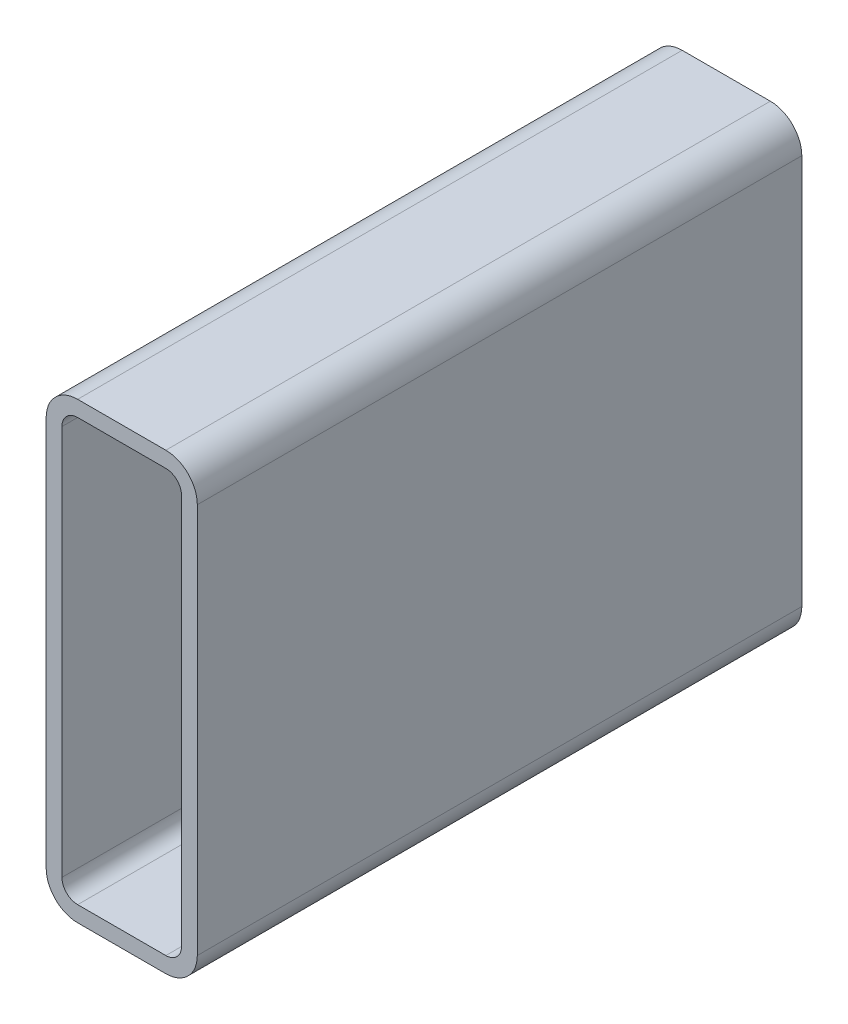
ISO-10303-21;
HEADER;
FILE_DESCRIPTION(('STEP AP214'),'2;1');
FILE_NAME('part.step','',(''),(''),'','','');
FILE_SCHEMA(('AUTOMOTIVE_DESIGN { 1 0 10303 214 1 1 1 1 }'));
ENDSEC;
DATA;
#1=APPLICATION_CONTEXT('core data for automotive mechanical design processes');
#2=APPLICATION_PROTOCOL_DEFINITION('international standard','automotive_design',2000,#1);
#3=PRODUCT_CONTEXT('',#1,'mechanical');
#4=PRODUCT('Part','Part','',(#3));
#5=PRODUCT_RELATED_PRODUCT_CATEGORY('part','',(#4));
#6=PRODUCT_DEFINITION_FORMATION('','',#4);
#7=PRODUCT_DEFINITION_CONTEXT('part definition',#1,'design');
#8=PRODUCT_DEFINITION('design','',#6,#7);
#9=PRODUCT_DEFINITION_SHAPE('','',#8);
#10=(LENGTH_UNIT() NAMED_UNIT(*) SI_UNIT(.MILLI.,.METRE.));
#11=(NAMED_UNIT(*) PLANE_ANGLE_UNIT() SI_UNIT($,.RADIAN.));
#12=(NAMED_UNIT(*) SI_UNIT($,.STERADIAN.) SOLID_ANGLE_UNIT());
#13=UNCERTAINTY_MEASURE_WITH_UNIT(LENGTH_MEASURE(1.E-05),#10,'distance_accuracy_value','');
#14=(GEOMETRIC_REPRESENTATION_CONTEXT(3) GLOBAL_UNCERTAINTY_ASSIGNED_CONTEXT((#13)) GLOBAL_UNIT_ASSIGNED_CONTEXT((#10,
#11,#12)) REPRESENTATION_CONTEXT('',''));
#15=CARTESIAN_POINT('',(0.,0.,0.));
#16=DIRECTION('',(0.,0.,1.));
#17=DIRECTION('',(1.,0.,0.));
#18=AXIS2_PLACEMENT_3D('',#15,#16,#17);
#19=CARTESIAN_POINT('',(18.3641160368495,214.668222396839,304.8));
#20=DIRECTION('',(0.,0.,1.));
#21=DIRECTION('',(1.,0.,0.));
#22=AXIS2_PLACEMENT_3D('',#19,#20,#21);
#23=PLANE('',#22);
#24=CARTESIAN_POINT('',(18.3641160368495,214.668222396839,304.8));
#25=DIRECTION('',(0.,0.,1.));
#26=DIRECTION('',(1.,0.,0.));
#27=AXIS2_PLACEMENT_3D('',#24,#25,#26);
#28=CIRCLE('',#27,15.875);
#29=CARTESIAN_POINT('',(18.3641160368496,230.543222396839,304.8));
#30=VERTEX_POINT('',#29);
#31=CARTESIAN_POINT('',(2.48911603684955,214.668222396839,304.8));
#32=VERTEX_POINT('',#31);
#33=EDGE_CURVE('E211',#30,#32,#28,.T.);
#34=ORIENTED_EDGE('',*,*,#33,.T.);
#35=DIRECTION('',(0.,-1.,0.));
#36=VECTOR('',#35,1.);
#37=CARTESIAN_POINT('',(2.48911603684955,17.8182223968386,304.8));
#38=LINE('',#37,#36);
#39=CARTESIAN_POINT('',(2.48911603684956,17.8182223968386,304.8));
#40=VERTEX_POINT('',#39);
#41=EDGE_CURVE('E214',#32,#40,#38,.T.);
#42=ORIENTED_EDGE('',*,*,#41,.T.);
#43=CARTESIAN_POINT('',(18.3641160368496,17.8182223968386,304.8));
#44=DIRECTION('',(0.,0.,1.));
#45=DIRECTION('',(1.,0.,0.));
#46=AXIS2_PLACEMENT_3D('',#43,#44,#45);
#47=CIRCLE('',#46,15.875);
#48=CARTESIAN_POINT('',(18.3641160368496,1.94322239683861,304.8));
#49=VERTEX_POINT('',#48);
#50=EDGE_CURVE('E217',#40,#49,#47,.T.);
#51=ORIENTED_EDGE('',*,*,#50,.T.);
#52=DIRECTION('',(1.,0.,0.));
#53=VECTOR('',#52,1.);
#54=CARTESIAN_POINT('',(62.8141160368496,1.94322239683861,304.8));
#55=LINE('',#54,#53);
#56=CARTESIAN_POINT('',(62.8141160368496,1.94322239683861,304.8));
#57=VERTEX_POINT('',#56);
#58=EDGE_CURVE('E219',#49,#57,#55,.T.);
#59=ORIENTED_EDGE('',*,*,#58,.T.);
#60=CARTESIAN_POINT('',(62.8141160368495,17.8182223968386,304.8));
#61=DIRECTION('',(0.,0.,1.));
#62=DIRECTION('',(1.,0.,0.));
#63=AXIS2_PLACEMENT_3D('',#60,#61,#62);
#64=CIRCLE('',#63,15.875);
#65=CARTESIAN_POINT('',(78.6891160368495,17.8182223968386,304.8));
#66=VERTEX_POINT('',#65);
#67=EDGE_CURVE('E221',#57,#66,#64,.T.);
#68=ORIENTED_EDGE('',*,*,#67,.T.);
#69=DIRECTION('',(0.,1.,0.));
#70=VECTOR('',#69,1.);
#71=CARTESIAN_POINT('',(78.6891160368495,214.668222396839,304.8));
#72=LINE('',#71,#70);
#73=CARTESIAN_POINT('',(78.6891160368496,214.668222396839,304.8));
#74=VERTEX_POINT('',#73);
#75=EDGE_CURVE('E223',#66,#74,#72,.T.);
#76=ORIENTED_EDGE('',*,*,#75,.T.);
#77=CARTESIAN_POINT('',(62.8141160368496,214.668222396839,304.8));
#78=DIRECTION('',(0.,0.,1.));
#79=DIRECTION('',(1.,0.,0.));
#80=AXIS2_PLACEMENT_3D('',#77,#78,#79);
#81=CIRCLE('',#80,15.875);
#82=CARTESIAN_POINT('',(62.8141160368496,230.543222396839,304.8));
#83=VERTEX_POINT('',#82);
#84=EDGE_CURVE('E225',#74,#83,#81,.T.);
#85=ORIENTED_EDGE('',*,*,#84,.T.);
#86=DIRECTION('',(-1.,0.,0.));
#87=VECTOR('',#86,1.);
#88=CARTESIAN_POINT('',(18.3641160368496,230.543222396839,304.8));
#89=LINE('',#88,#87);
#90=EDGE_CURVE('E227',#83,#30,#89,.T.);
#91=ORIENTED_EDGE('',*,*,#90,.T.);
#92=EDGE_LOOP('',(#34,#42,#51,#59,#68,#76,#85,#91));
#93=FACE_BOUND('',#92,.T.);
#94=DIRECTION('',(0.,-1.,0.));
#95=VECTOR('',#94,1.);
#96=CARTESIAN_POINT('',(10.4266160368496,17.8182223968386,304.8));
#97=LINE('',#96,#95);
#98=CARTESIAN_POINT('',(10.4266160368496,214.668222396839,304.8));
#99=VERTEX_POINT('',#98);
#100=CARTESIAN_POINT('',(10.4266160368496,17.8182223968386,304.8));
#101=VERTEX_POINT('',#100);
#102=EDGE_CURVE('E154',#99,#101,#97,.T.);
#103=ORIENTED_EDGE('',*,*,#102,.F.);
#104=CARTESIAN_POINT('',(18.3641160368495,214.668222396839,304.8));
#105=DIRECTION('',(0.,0.,1.));
#106=DIRECTION('',(1.,0.,0.));
#107=AXIS2_PLACEMENT_3D('',#104,#105,#106);
#108=CIRCLE('',#107,7.9375);
#109=CARTESIAN_POINT('',(18.3641160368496,222.605722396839,304.8));
#110=VERTEX_POINT('',#109);
#111=EDGE_CURVE('E146',#110,#99,#108,.T.);
#112=ORIENTED_EDGE('',*,*,#111,.F.);
#113=DIRECTION('',(-1.,0.,0.));
#114=VECTOR('',#113,1.);
#115=CARTESIAN_POINT('',(18.3641160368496,222.605722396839,304.8));
#116=LINE('',#115,#114);
#117=CARTESIAN_POINT('',(62.8141160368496,222.605722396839,304.8));
#118=VERTEX_POINT('',#117);
#119=EDGE_CURVE('E179',#118,#110,#116,.T.);
#120=ORIENTED_EDGE('',*,*,#119,.F.);
#121=CARTESIAN_POINT('',(62.8141160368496,214.668222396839,304.8));
#122=DIRECTION('',(0.,0.,1.));
#123=DIRECTION('',(1.,0.,0.));
#124=AXIS2_PLACEMENT_3D('',#121,#122,#123);
#125=CIRCLE('',#124,7.9375);
#126=CARTESIAN_POINT('',(70.7516160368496,214.668222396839,304.8));
#127=VERTEX_POINT('',#126);
#128=EDGE_CURVE('E177',#127,#118,#125,.T.);
#129=ORIENTED_EDGE('',*,*,#128,.F.);
#130=DIRECTION('',(0.,1.,0.));
#131=VECTOR('',#130,1.);
#132=CARTESIAN_POINT('',(70.7516160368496,214.668222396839,304.8));
#133=LINE('',#132,#131);
#134=CARTESIAN_POINT('',(70.7516160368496,17.8182223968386,304.8));
#135=VERTEX_POINT('',#134);
#136=EDGE_CURVE('E175',#135,#127,#133,.T.);
#137=ORIENTED_EDGE('',*,*,#136,.F.);
#138=CARTESIAN_POINT('',(62.8141160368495,17.8182223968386,304.8));
#139=DIRECTION('',(0.,0.,1.));
#140=DIRECTION('',(1.,0.,0.));
#141=AXIS2_PLACEMENT_3D('',#138,#139,#140);
#142=CIRCLE('',#141,7.9375);
#143=CARTESIAN_POINT('',(62.8141160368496,9.8807223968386,304.8));
#144=VERTEX_POINT('',#143);
#145=EDGE_CURVE('E173',#144,#135,#142,.T.);
#146=ORIENTED_EDGE('',*,*,#145,.F.);
#147=DIRECTION('',(1.,0.,0.));
#148=VECTOR('',#147,1.);
#149=CARTESIAN_POINT('',(62.8141160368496,9.88072239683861,304.8));
#150=LINE('',#149,#148);
#151=CARTESIAN_POINT('',(18.3641160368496,9.88072239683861,304.8));
#152=VERTEX_POINT('',#151);
#153=EDGE_CURVE('E169',#152,#144,#150,.T.);
#154=ORIENTED_EDGE('',*,*,#153,.F.);
#155=CARTESIAN_POINT('',(18.3641160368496,17.8182223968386,304.8));
#156=DIRECTION('',(0.,0.,1.));
#157=DIRECTION('',(1.,0.,0.));
#158=AXIS2_PLACEMENT_3D('',#155,#156,#157);
#159=CIRCLE('',#158,7.9375);
#160=EDGE_CURVE('E167',#101,#152,#159,.T.);
#161=ORIENTED_EDGE('',*,*,#160,.F.);
#162=EDGE_LOOP('',(#103,#112,#120,#129,#137,#146,#154,#161));
#163=FACE_BOUND('',#162,.T.);
#164=ADVANCED_FACE('F33',(#93,#163),#23,.T.);
#165=CARTESIAN_POINT('',(18.3641160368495,214.668222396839,0.));
#166=DIRECTION('',(0.,0.,1.));
#167=DIRECTION('',(1.,0.,0.));
#168=AXIS2_PLACEMENT_3D('',#165,#166,#167);
#169=PLANE('',#168);
#170=CARTESIAN_POINT('',(18.3641160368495,214.668222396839,0.));
#171=DIRECTION('',(0.,0.,1.));
#172=DIRECTION('',(1.,0.,0.));
#173=AXIS2_PLACEMENT_3D('',#170,#171,#172);
#174=CIRCLE('',#173,15.875);
#175=CARTESIAN_POINT('',(18.3641160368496,230.543222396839,0.));
#176=VERTEX_POINT('',#175);
#177=CARTESIAN_POINT('',(2.48911603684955,214.668222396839,0.));
#178=VERTEX_POINT('',#177);
#179=EDGE_CURVE('E162',#176,#178,#174,.T.);
#180=ORIENTED_EDGE('',*,*,#179,.F.);
#181=DIRECTION('',(-1.,0.,0.));
#182=VECTOR('',#181,1.);
#183=CARTESIAN_POINT('',(18.3641160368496,230.543222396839,0.));
#184=LINE('',#183,#182);
#185=CARTESIAN_POINT('',(62.8141160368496,230.543222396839,0.));
#186=VERTEX_POINT('',#185);
#187=EDGE_CURVE('E215',#186,#176,#184,.T.);
#188=ORIENTED_EDGE('',*,*,#187,.F.);
#189=CARTESIAN_POINT('',(62.8141160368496,214.668222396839,0.));
#190=DIRECTION('',(0.,0.,1.));
#191=DIRECTION('',(1.,0.,0.));
#192=AXIS2_PLACEMENT_3D('',#189,#190,#191);
#193=CIRCLE('',#192,15.875);
#194=CARTESIAN_POINT('',(78.6891160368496,214.668222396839,0.));
#195=VERTEX_POINT('',#194);
#196=EDGE_CURVE('E242',#195,#186,#193,.T.);
#197=ORIENTED_EDGE('',*,*,#196,.F.);
#198=DIRECTION('',(0.,1.,0.));
#199=VECTOR('',#198,1.);
#200=CARTESIAN_POINT('',(78.6891160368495,214.668222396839,0.));
#201=LINE('',#200,#199);
#202=CARTESIAN_POINT('',(78.6891160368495,17.8182223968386,0.));
#203=VERTEX_POINT('',#202);
#204=EDGE_CURVE('E240',#203,#195,#201,.T.);
#205=ORIENTED_EDGE('',*,*,#204,.F.);
#206=CARTESIAN_POINT('',(62.8141160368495,17.8182223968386,0.));
#207=DIRECTION('',(0.,0.,1.));
#208=DIRECTION('',(1.,0.,0.));
#209=AXIS2_PLACEMENT_3D('',#206,#207,#208);
#210=CIRCLE('',#209,15.875);
#211=CARTESIAN_POINT('',(62.8141160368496,1.94322239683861,0.));
#212=VERTEX_POINT('',#211);
#213=EDGE_CURVE('E238',#212,#203,#210,.T.);
#214=ORIENTED_EDGE('',*,*,#213,.F.);
#215=DIRECTION('',(1.,0.,0.));
#216=VECTOR('',#215,1.);
#217=CARTESIAN_POINT('',(62.8141160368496,1.94322239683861,0.));
#218=LINE('',#217,#216);
#219=CARTESIAN_POINT('',(18.3641160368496,1.94322239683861,0.));
#220=VERTEX_POINT('',#219);
#221=EDGE_CURVE('E236',#220,#212,#218,.T.);
#222=ORIENTED_EDGE('',*,*,#221,.F.);
#223=CARTESIAN_POINT('',(18.3641160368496,17.8182223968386,0.));
#224=DIRECTION('',(0.,0.,1.));
#225=DIRECTION('',(1.,0.,0.));
#226=AXIS2_PLACEMENT_3D('',#223,#224,#225);
#227=CIRCLE('',#226,15.875);
#228=CARTESIAN_POINT('',(2.48911603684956,17.8182223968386,0.));
#229=VERTEX_POINT('',#228);
#230=EDGE_CURVE('E234',#229,#220,#227,.T.);
#231=ORIENTED_EDGE('',*,*,#230,.F.);
#232=DIRECTION('',(0.,-1.,0.));
#233=VECTOR('',#232,1.);
#234=CARTESIAN_POINT('',(2.48911603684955,17.8182223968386,0.));
#235=LINE('',#234,#233);
#236=EDGE_CURVE('E232',#178,#229,#235,.T.);
#237=ORIENTED_EDGE('',*,*,#236,.F.);
#238=EDGE_LOOP('',(#180,#188,#197,#205,#214,#222,#231,#237));
#239=FACE_BOUND('',#238,.T.);
#240=CARTESIAN_POINT('',(18.3641160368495,214.668222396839,0.));
#241=DIRECTION('',(0.,0.,1.));
#242=DIRECTION('',(1.,0.,0.));
#243=AXIS2_PLACEMENT_3D('',#240,#241,#242);
#244=CIRCLE('',#243,7.9375);
#245=CARTESIAN_POINT('',(18.3641160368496,222.605722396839,0.));
#246=VERTEX_POINT('',#245);
#247=CARTESIAN_POINT('',(10.4266160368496,214.668222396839,0.));
#248=VERTEX_POINT('',#247);
#249=EDGE_CURVE('E56',#246,#248,#244,.T.);
#250=ORIENTED_EDGE('',*,*,#249,.T.);
#251=DIRECTION('',(0.,-1.,0.));
#252=VECTOR('',#251,1.);
#253=CARTESIAN_POINT('',(10.4266160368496,17.8182223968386,0.));
#254=LINE('',#253,#252);
#255=CARTESIAN_POINT('',(10.4266160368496,17.8182223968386,0.));
#256=VERTEX_POINT('',#255);
#257=EDGE_CURVE('E161',#248,#256,#254,.T.);
#258=ORIENTED_EDGE('',*,*,#257,.T.);
#259=CARTESIAN_POINT('',(18.3641160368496,17.8182223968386,0.));
#260=DIRECTION('',(0.,0.,1.));
#261=DIRECTION('',(1.,0.,0.));
#262=AXIS2_PLACEMENT_3D('',#259,#260,#261);
#263=CIRCLE('',#262,7.9375);
#264=CARTESIAN_POINT('',(18.3641160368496,9.88072239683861,0.));
#265=VERTEX_POINT('',#264);
#266=EDGE_CURVE('E183',#256,#265,#263,.T.);
#267=ORIENTED_EDGE('',*,*,#266,.T.);
#268=DIRECTION('',(1.,0.,0.));
#269=VECTOR('',#268,1.);
#270=CARTESIAN_POINT('',(62.8141160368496,9.88072239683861,0.));
#271=LINE('',#270,#269);
#272=CARTESIAN_POINT('',(62.8141160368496,9.8807223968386,0.));
#273=VERTEX_POINT('',#272);
#274=EDGE_CURVE('E186',#265,#273,#271,.T.);
#275=ORIENTED_EDGE('',*,*,#274,.T.);
#276=CARTESIAN_POINT('',(62.8141160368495,17.8182223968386,0.));
#277=DIRECTION('',(0.,0.,1.));
#278=DIRECTION('',(1.,0.,0.));
#279=AXIS2_PLACEMENT_3D('',#276,#277,#278);
#280=CIRCLE('',#279,7.9375);
#281=CARTESIAN_POINT('',(70.7516160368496,17.8182223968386,0.));
#282=VERTEX_POINT('',#281);
#283=EDGE_CURVE('E189',#273,#282,#280,.T.);
#284=ORIENTED_EDGE('',*,*,#283,.T.);
#285=DIRECTION('',(0.,1.,0.));
#286=VECTOR('',#285,1.);
#287=CARTESIAN_POINT('',(70.7516160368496,214.668222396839,0.));
#288=LINE('',#287,#286);
#289=CARTESIAN_POINT('',(70.7516160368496,214.668222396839,0.));
#290=VERTEX_POINT('',#289);
#291=EDGE_CURVE('E192',#282,#290,#288,.T.);
#292=ORIENTED_EDGE('',*,*,#291,.T.);
#293=CARTESIAN_POINT('',(62.8141160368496,214.668222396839,0.));
#294=DIRECTION('',(0.,0.,1.));
#295=DIRECTION('',(1.,0.,0.));
#296=AXIS2_PLACEMENT_3D('',#293,#294,#295);
#297=CIRCLE('',#296,7.9375);
#298=CARTESIAN_POINT('',(62.8141160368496,222.605722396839,0.));
#299=VERTEX_POINT('',#298);
#300=EDGE_CURVE('E195',#290,#299,#297,.T.);
#301=ORIENTED_EDGE('',*,*,#300,.T.);
#302=DIRECTION('',(-1.,0.,0.));
#303=VECTOR('',#302,1.);
#304=CARTESIAN_POINT('',(18.3641160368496,222.605722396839,0.));
#305=LINE('',#304,#303);
#306=EDGE_CURVE('E155',#299,#246,#305,.T.);
#307=ORIENTED_EDGE('',*,*,#306,.T.);
#308=EDGE_LOOP('',(#250,#258,#267,#275,#284,#292,#301,#307));
#309=FACE_BOUND('',#308,.T.);
#310=ADVANCED_FACE('F272',(#239,#309),#169,.F.);
#311=CARTESIAN_POINT('',(18.3641160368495,214.668222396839,304.8));
#312=DIRECTION('',(0.,0.,-1.));
#313=DIRECTION('',(-1.,0.,0.));
#314=AXIS2_PLACEMENT_3D('',#311,#312,#313);
#315=CYLINDRICAL_SURFACE('',#314,15.875);
#316=ORIENTED_EDGE('',*,*,#179,.T.);
#317=DIRECTION('',(0.,0.,-1.));
#318=VECTOR('',#317,1.);
#319=CARTESIAN_POINT('',(2.48911603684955,214.668222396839,304.8));
#320=LINE('',#319,#318);
#321=EDGE_CURVE('E11',#32,#178,#320,.T.);
#322=ORIENTED_EDGE('',*,*,#321,.F.);
#323=ORIENTED_EDGE('',*,*,#33,.F.);
#324=DIRECTION('',(0.,0.,-1.));
#325=VECTOR('',#324,1.);
#326=CARTESIAN_POINT('',(18.3641160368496,230.543222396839,304.8));
#327=LINE('',#326,#325);
#328=EDGE_CURVE('E229',#30,#176,#327,.T.);
#329=ORIENTED_EDGE('',*,*,#328,.T.);
#330=EDGE_LOOP('',(#316,#322,#323,#329));
#331=FACE_BOUND('',#330,.T.);
#332=ADVANCED_FACE('F35',(#331),#315,.T.);
#333=CARTESIAN_POINT('',(2.48911603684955,17.8182223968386,304.8));
#334=DIRECTION('',(1.,0.,0.));
#335=DIRECTION('',(0.,0.,-1.));
#336=AXIS2_PLACEMENT_3D('',#333,#334,#335);
#337=PLANE('',#336);
#338=ORIENTED_EDGE('',*,*,#236,.T.);
#339=DIRECTION('',(0.,0.,-1.));
#340=VECTOR('',#339,1.);
#341=CARTESIAN_POINT('',(2.48911603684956,17.8182223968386,304.8));
#342=LINE('',#341,#340);
#343=EDGE_CURVE('E41',#40,#229,#342,.T.);
#344=ORIENTED_EDGE('',*,*,#343,.F.);
#345=ORIENTED_EDGE('',*,*,#41,.F.);
#346=ORIENTED_EDGE('',*,*,#321,.T.);
#347=EDGE_LOOP('',(#338,#344,#345,#346));
#348=FACE_BOUND('',#347,.T.);
#349=ADVANCED_FACE('F289',(#348),#337,.F.);
#350=CARTESIAN_POINT('',(18.3641160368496,17.8182223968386,304.8));
#351=DIRECTION('',(0.,0.,-1.));
#352=DIRECTION('',(-1.,0.,0.));
#353=AXIS2_PLACEMENT_3D('',#350,#351,#352);
#354=CYLINDRICAL_SURFACE('',#353,15.875);
#355=ORIENTED_EDGE('',*,*,#230,.T.);
#356=DIRECTION('',(0.,0.,-1.));
#357=VECTOR('',#356,1.);
#358=CARTESIAN_POINT('',(18.3641160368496,1.94322239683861,304.8));
#359=LINE('',#358,#357);
#360=EDGE_CURVE('E259',#49,#220,#359,.T.);
#361=ORIENTED_EDGE('',*,*,#360,.F.);
#362=ORIENTED_EDGE('',*,*,#50,.F.);
#363=ORIENTED_EDGE('',*,*,#343,.T.);
#364=EDGE_LOOP('',(#355,#361,#362,#363));
#365=FACE_BOUND('',#364,.T.);
#366=ADVANCED_FACE('F266',(#365),#354,.T.);
#367=CARTESIAN_POINT('',(62.8141160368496,1.94322239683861,304.8));
#368=DIRECTION('',(0.,1.,0.));
#369=DIRECTION('',(0.,0.,1.));
#370=AXIS2_PLACEMENT_3D('',#367,#368,#369);
#371=PLANE('',#370);
#372=ORIENTED_EDGE('',*,*,#221,.T.);
#373=DIRECTION('',(0.,0.,-1.));
#374=VECTOR('',#373,1.);
#375=CARTESIAN_POINT('',(62.8141160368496,1.94322239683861,304.8));
#376=LINE('',#375,#374);
#377=EDGE_CURVE('E256',#57,#212,#376,.T.);
#378=ORIENTED_EDGE('',*,*,#377,.F.);
#379=ORIENTED_EDGE('',*,*,#58,.F.);
#380=ORIENTED_EDGE('',*,*,#360,.T.);
#381=EDGE_LOOP('',(#372,#378,#379,#380));
#382=FACE_BOUND('',#381,.T.);
#383=ADVANCED_FACE('F278',(#382),#371,.F.);
#384=CARTESIAN_POINT('',(62.8141160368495,17.8182223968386,304.8));
#385=DIRECTION('',(0.,0.,-1.));
#386=DIRECTION('',(-1.,0.,0.));
#387=AXIS2_PLACEMENT_3D('',#384,#385,#386);
#388=CYLINDRICAL_SURFACE('',#387,15.875);
#389=ORIENTED_EDGE('',*,*,#213,.T.);
#390=DIRECTION('',(0.,0.,-1.));
#391=VECTOR('',#390,1.);
#392=CARTESIAN_POINT('',(78.6891160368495,17.8182223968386,304.8));
#393=LINE('',#392,#391);
#394=EDGE_CURVE('E253',#66,#203,#393,.T.);
#395=ORIENTED_EDGE('',*,*,#394,.F.);
#396=ORIENTED_EDGE('',*,*,#67,.F.);
#397=ORIENTED_EDGE('',*,*,#377,.T.);
#398=EDGE_LOOP('',(#389,#395,#396,#397));
#399=FACE_BOUND('',#398,.T.);
#400=ADVANCED_FACE('F282',(#399),#388,.T.);
#401=CARTESIAN_POINT('',(78.6891160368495,214.668222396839,304.8));
#402=DIRECTION('',(-1.,0.,0.));
#403=DIRECTION('',(0.,0.,1.));
#404=AXIS2_PLACEMENT_3D('',#401,#402,#403);
#405=PLANE('',#404);
#406=ORIENTED_EDGE('',*,*,#204,.T.);
#407=DIRECTION('',(0.,0.,-1.));
#408=VECTOR('',#407,1.);
#409=CARTESIAN_POINT('',(78.6891160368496,214.668222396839,304.8));
#410=LINE('',#409,#408);
#411=EDGE_CURVE('E250',#74,#195,#410,.T.);
#412=ORIENTED_EDGE('',*,*,#411,.F.);
#413=ORIENTED_EDGE('',*,*,#75,.F.);
#414=ORIENTED_EDGE('',*,*,#394,.T.);
#415=EDGE_LOOP('',(#406,#412,#413,#414));
#416=FACE_BOUND('',#415,.T.);
#417=ADVANCED_FACE('F302',(#416),#405,.F.);
#418=CARTESIAN_POINT('',(62.8141160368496,214.668222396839,304.8));
#419=DIRECTION('',(0.,0.,-1.));
#420=DIRECTION('',(-1.,0.,0.));
#421=AXIS2_PLACEMENT_3D('',#418,#419,#420);
#422=CYLINDRICAL_SURFACE('',#421,15.875);
#423=ORIENTED_EDGE('',*,*,#196,.T.);
#424=DIRECTION('',(0.,0.,-1.));
#425=VECTOR('',#424,1.);
#426=CARTESIAN_POINT('',(62.8141160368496,230.543222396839,304.8));
#427=LINE('',#426,#425);
#428=EDGE_CURVE('E247',#83,#186,#427,.T.);
#429=ORIENTED_EDGE('',*,*,#428,.F.);
#430=ORIENTED_EDGE('',*,*,#84,.F.);
#431=ORIENTED_EDGE('',*,*,#411,.T.);
#432=EDGE_LOOP('',(#423,#429,#430,#431));
#433=FACE_BOUND('',#432,.T.);
#434=ADVANCED_FACE('F300',(#433),#422,.T.);
#435=CARTESIAN_POINT('',(18.3641160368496,230.543222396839,304.8));
#436=DIRECTION('',(0.,-1.,0.));
#437=DIRECTION('',(0.,0.,-1.));
#438=AXIS2_PLACEMENT_3D('',#435,#436,#437);
#439=PLANE('',#438);
#440=ORIENTED_EDGE('',*,*,#187,.T.);
#441=ORIENTED_EDGE('',*,*,#328,.F.);
#442=ORIENTED_EDGE('',*,*,#90,.F.);
#443=ORIENTED_EDGE('',*,*,#428,.T.);
#444=EDGE_LOOP('',(#440,#441,#442,#443));
#445=FACE_BOUND('',#444,.T.);
#446=ADVANCED_FACE('F295',(#445),#439,.F.);
#447=CARTESIAN_POINT('',(18.3641160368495,214.668222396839,304.8));
#448=DIRECTION('',(0.,0.,-1.));
#449=DIRECTION('',(-1.,0.,0.));
#450=AXIS2_PLACEMENT_3D('',#447,#448,#449);
#451=CYLINDRICAL_SURFACE('',#450,7.9375);
#452=ORIENTED_EDGE('',*,*,#249,.F.);
#453=DIRECTION('',(0.,0.,-1.));
#454=VECTOR('',#453,1.);
#455=CARTESIAN_POINT('',(18.3641160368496,222.605722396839,304.8));
#456=LINE('',#455,#454);
#457=EDGE_CURVE('E150',#110,#246,#456,.T.);
#458=ORIENTED_EDGE('',*,*,#457,.F.);
#459=ORIENTED_EDGE('',*,*,#111,.T.);
#460=DIRECTION('',(0.,0.,-1.));
#461=VECTOR('',#460,1.);
#462=CARTESIAN_POINT('',(10.4266160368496,214.668222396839,304.8));
#463=LINE('',#462,#461);
#464=EDGE_CURVE('E149',#99,#248,#463,.T.);
#465=ORIENTED_EDGE('',*,*,#464,.T.);
#466=EDGE_LOOP('',(#452,#458,#459,#465));
#467=FACE_BOUND('',#466,.T.);
#468=ADVANCED_FACE('F148',(#467),#451,.F.);
#469=CARTESIAN_POINT('',(10.4266160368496,17.8182223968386,304.8));
#470=DIRECTION('',(1.,0.,0.));
#471=DIRECTION('',(0.,0.,-1.));
#472=AXIS2_PLACEMENT_3D('',#469,#470,#471);
#473=PLANE('',#472);
#474=ORIENTED_EDGE('',*,*,#257,.F.);
#475=ORIENTED_EDGE('',*,*,#464,.F.);
#476=ORIENTED_EDGE('',*,*,#102,.T.);
#477=DIRECTION('',(0.,0.,-1.));
#478=VECTOR('',#477,1.);
#479=CARTESIAN_POINT('',(10.4266160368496,17.8182223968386,304.8));
#480=LINE('',#479,#478);
#481=EDGE_CURVE('E163',#101,#256,#480,.T.);
#482=ORIENTED_EDGE('',*,*,#481,.T.);
#483=EDGE_LOOP('',(#474,#475,#476,#482));
#484=FACE_BOUND('',#483,.T.);
#485=ADVANCED_FACE('F158',(#484),#473,.T.);
#486=CARTESIAN_POINT('',(18.3641160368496,17.8182223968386,304.8));
#487=DIRECTION('',(0.,0.,-1.));
#488=DIRECTION('',(-1.,0.,0.));
#489=AXIS2_PLACEMENT_3D('',#486,#487,#488);
#490=CYLINDRICAL_SURFACE('',#489,7.9375);
#491=ORIENTED_EDGE('',*,*,#266,.F.);
#492=ORIENTED_EDGE('',*,*,#481,.F.);
#493=ORIENTED_EDGE('',*,*,#160,.T.);
#494=DIRECTION('',(0.,0.,-1.));
#495=VECTOR('',#494,1.);
#496=CARTESIAN_POINT('',(18.3641160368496,9.88072239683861,304.8));
#497=LINE('',#496,#495);
#498=EDGE_CURVE('E208',#152,#265,#497,.T.);
#499=ORIENTED_EDGE('',*,*,#498,.T.);
#500=EDGE_LOOP('',(#491,#492,#493,#499));
#501=FACE_BOUND('',#500,.T.);
#502=ADVANCED_FACE('F327',(#501),#490,.F.);
#503=CARTESIAN_POINT('',(62.8141160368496,9.88072239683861,304.8));
#504=DIRECTION('',(0.,1.,0.));
#505=DIRECTION('',(0.,0.,1.));
#506=AXIS2_PLACEMENT_3D('',#503,#504,#505);
#507=PLANE('',#506);
#508=ORIENTED_EDGE('',*,*,#274,.F.);
#509=ORIENTED_EDGE('',*,*,#498,.F.);
#510=ORIENTED_EDGE('',*,*,#153,.T.);
#511=DIRECTION('',(0.,0.,-1.));
#512=VECTOR('',#511,1.);
#513=CARTESIAN_POINT('',(62.8141160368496,9.8807223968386,304.8));
#514=LINE('',#513,#512);
#515=EDGE_CURVE('E206',#144,#273,#514,.T.);
#516=ORIENTED_EDGE('',*,*,#515,.T.);
#517=EDGE_LOOP('',(#508,#509,#510,#516));
#518=FACE_BOUND('',#517,.T.);
#519=ADVANCED_FACE('F331',(#518),#507,.T.);
#520=CARTESIAN_POINT('',(62.8141160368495,17.8182223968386,304.8));
#521=DIRECTION('',(0.,0.,-1.));
#522=DIRECTION('',(-1.,0.,0.));
#523=AXIS2_PLACEMENT_3D('',#520,#521,#522);
#524=CYLINDRICAL_SURFACE('',#523,7.9375);
#525=ORIENTED_EDGE('',*,*,#283,.F.);
#526=ORIENTED_EDGE('',*,*,#515,.F.);
#527=ORIENTED_EDGE('',*,*,#145,.T.);
#528=DIRECTION('',(0.,0.,-1.));
#529=VECTOR('',#528,1.);
#530=CARTESIAN_POINT('',(70.7516160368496,17.8182223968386,304.8));
#531=LINE('',#530,#529);
#532=EDGE_CURVE('E204',#135,#282,#531,.T.);
#533=ORIENTED_EDGE('',*,*,#532,.T.);
#534=EDGE_LOOP('',(#525,#526,#527,#533));
#535=FACE_BOUND('',#534,.T.);
#536=ADVANCED_FACE('F337',(#535),#524,.F.);
#537=CARTESIAN_POINT('',(70.7516160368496,214.668222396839,304.8));
#538=DIRECTION('',(-1.,0.,0.));
#539=DIRECTION('',(0.,0.,1.));
#540=AXIS2_PLACEMENT_3D('',#537,#538,#539);
#541=PLANE('',#540);
#542=ORIENTED_EDGE('',*,*,#291,.F.);
#543=ORIENTED_EDGE('',*,*,#532,.F.);
#544=ORIENTED_EDGE('',*,*,#136,.T.);
#545=DIRECTION('',(0.,0.,-1.));
#546=VECTOR('',#545,1.);
#547=CARTESIAN_POINT('',(70.7516160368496,214.668222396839,304.8));
#548=LINE('',#547,#546);
#549=EDGE_CURVE('E202',#127,#290,#548,.T.);
#550=ORIENTED_EDGE('',*,*,#549,.T.);
#551=EDGE_LOOP('',(#542,#543,#544,#550));
#552=FACE_BOUND('',#551,.T.);
#553=ADVANCED_FACE('F341',(#552),#541,.T.);
#554=CARTESIAN_POINT('',(62.8141160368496,214.668222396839,304.8));
#555=DIRECTION('',(0.,0.,-1.));
#556=DIRECTION('',(-1.,0.,0.));
#557=AXIS2_PLACEMENT_3D('',#554,#555,#556);
#558=CYLINDRICAL_SURFACE('',#557,7.9375);
#559=ORIENTED_EDGE('',*,*,#300,.F.);
#560=ORIENTED_EDGE('',*,*,#549,.F.);
#561=ORIENTED_EDGE('',*,*,#128,.T.);
#562=DIRECTION('',(0.,0.,-1.));
#563=VECTOR('',#562,1.);
#564=CARTESIAN_POINT('',(62.8141160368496,222.605722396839,304.8));
#565=LINE('',#564,#563);
#566=EDGE_CURVE('E48',#118,#299,#565,.T.);
#567=ORIENTED_EDGE('',*,*,#566,.T.);
#568=EDGE_LOOP('',(#559,#560,#561,#567));
#569=FACE_BOUND('',#568,.T.);
#570=ADVANCED_FACE('F345',(#569),#558,.F.);
#571=CARTESIAN_POINT('',(18.3641160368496,222.605722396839,304.8));
#572=DIRECTION('',(0.,-1.,0.));
#573=DIRECTION('',(0.,0.,-1.));
#574=AXIS2_PLACEMENT_3D('',#571,#572,#573);
#575=PLANE('',#574);
#576=ORIENTED_EDGE('',*,*,#306,.F.);
#577=ORIENTED_EDGE('',*,*,#566,.F.);
#578=ORIENTED_EDGE('',*,*,#119,.T.);
#579=ORIENTED_EDGE('',*,*,#457,.T.);
#580=EDGE_LOOP('',(#576,#577,#578,#579));
#581=FACE_BOUND('',#580,.T.);
#582=ADVANCED_FACE('F349',(#581),#575,.T.);
#583=CLOSED_SHELL('',(#164,#310,#332,#349,#366,#383,#400,#417,#434,#446,#468,#485,#502,#519,
#536,#553,#570,#582));
#584=MANIFOLD_SOLID_BREP('B2',#583);
#585=ADVANCED_BREP_SHAPE_REPRESENTATION('',(#18,#584),#14);
#586=SHAPE_DEFINITION_REPRESENTATION(#9,#585);
ENDSEC;
END-ISO-10303-21;
